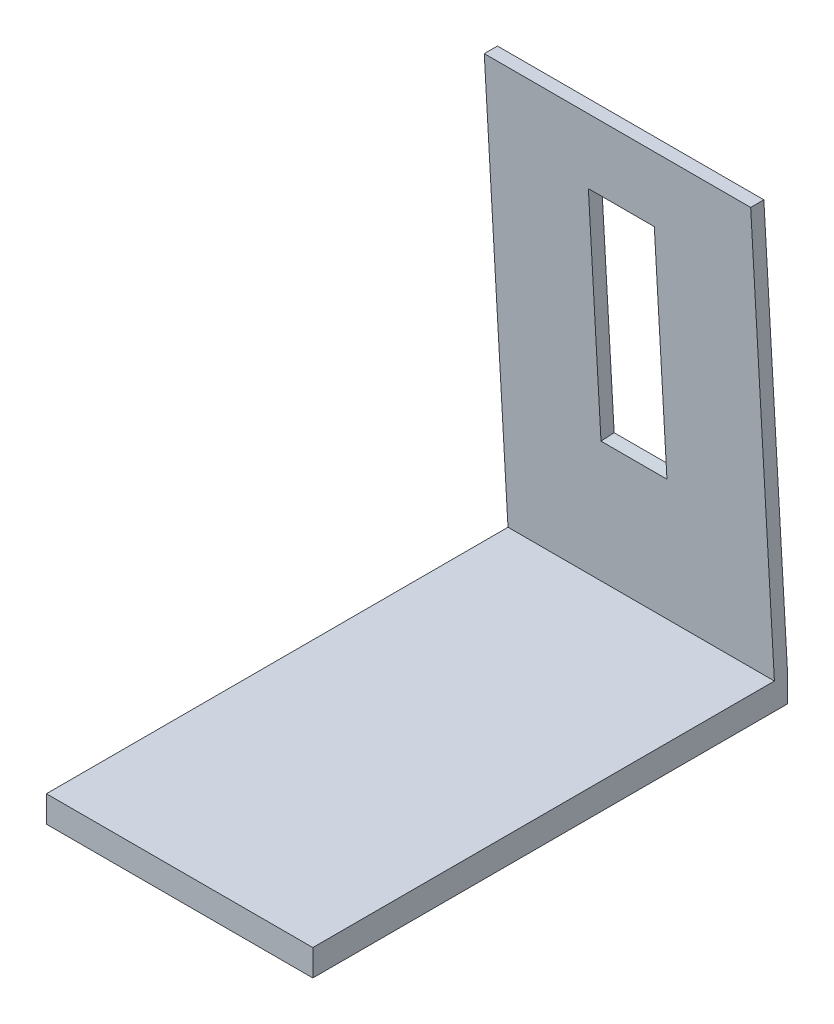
from build123d import *

# Parameters (mm, degrees)
SKETCH1_W                  = 12.827
SKETCH1_H                  = 22.86
EXTRUDE1_DEPTH             = 1.27
EXTRUDE2_REACH             = 25.777
EXTRUDE2_DIRECTION_2_REACH = 25.777
SKETCH3_W                  = 3.175
SKETCH3_H                  = 10.852818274
CUT_EXTRUDE1_DEPTH         = 0.633997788


with BuildPart() as part:
    # Sketch1 → Extrude1 (new body)
    with BuildSketch(Plane(origin=(0, 0, 0), x_dir=(1, 0, 0), z_dir=(0, 1, 0))):
        with Locations((0, 11.43)):
            Rectangle(SKETCH1_W, SKETCH1_H)
    extrude(amount=EXTRUDE1_DEPTH)

    # Extrude2: up to this face of the body (flat: up to its plane)
    extrude2_end = Plane(part.part.faces().sort_by_distance((6.4135, 0.635, -11.43))[0])
    # Sketch2 → Extrude2 (add, up to the picked face)
    with BuildSketch(Plane(origin=(0, 0, 0), x_dir=(0, 0, -1), z_dir=(1, 0, 0)), mode=Mode.PRIVATE) as extrude2_sk1:
        Polygon((22.86, 1.27), (21.717, 21.59), (21.082, 21.59), (22.225, 1.27), align=None)
    extrude2_tool1 = split(extrude(extrude2_sk1.sketch, amount=EXTRUDE2_REACH, mode=Mode.PRIVATE), bisect_by=extrude2_end, keep=Keep.BOTH, mode=Mode.PRIVATE)
    add(extrude2_tool1.solids().sort_by(Axis((0, 11.43, -21.971), (1, 0, 0)))[0])

    # Extrude2 direction 2: up to this face of the body (flat: up to its plane)
    extrude2_direction_2_end = Plane(part.part.faces().sort_by_distance((-6.4135, 0.635, -11.43))[0])
    # Sketch2 → Extrude2 direction 2 (add, up to the picked face)
    with BuildSketch(Plane(origin=(0, 0, 0), x_dir=(0, 0, -1), z_dir=(1, 0, 0)), mode=Mode.PRIVATE) as extrude2_direction_2_sk1:
        Polygon((22.86, 1.27), (21.717, 21.59), (21.082, 21.59), (22.225, 1.27), align=None)
    extrude2_direction_2_tool1 = split(extrude(extrude2_direction_2_sk1.sketch, amount=-EXTRUDE2_DIRECTION_2_REACH, mode=Mode.PRIVATE), bisect_by=extrude2_direction_2_end, keep=Keep.BOTH, mode=Mode.PRIVATE)
    add(extrude2_direction_2_tool1.solids().sort_by(Axis((0, 11.43, -21.971), (-1, 0, 0)))[0])

    # Sketch3 → Cut-Extrude1 (cut)
    with BuildSketch(Plane(origin=(0, 1.285824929, -22.859109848), x_dir=(-1, 0, 0), z_dir=(0, 0.056161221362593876, -0.9984217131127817))):
        with Locations((0, 11.632310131)):
            Rectangle(SKETCH3_W, SKETCH3_H)
    extrude(amount=-CUT_EXTRUDE1_DEPTH, mode=Mode.SUBTRACT)


solid = part.part
